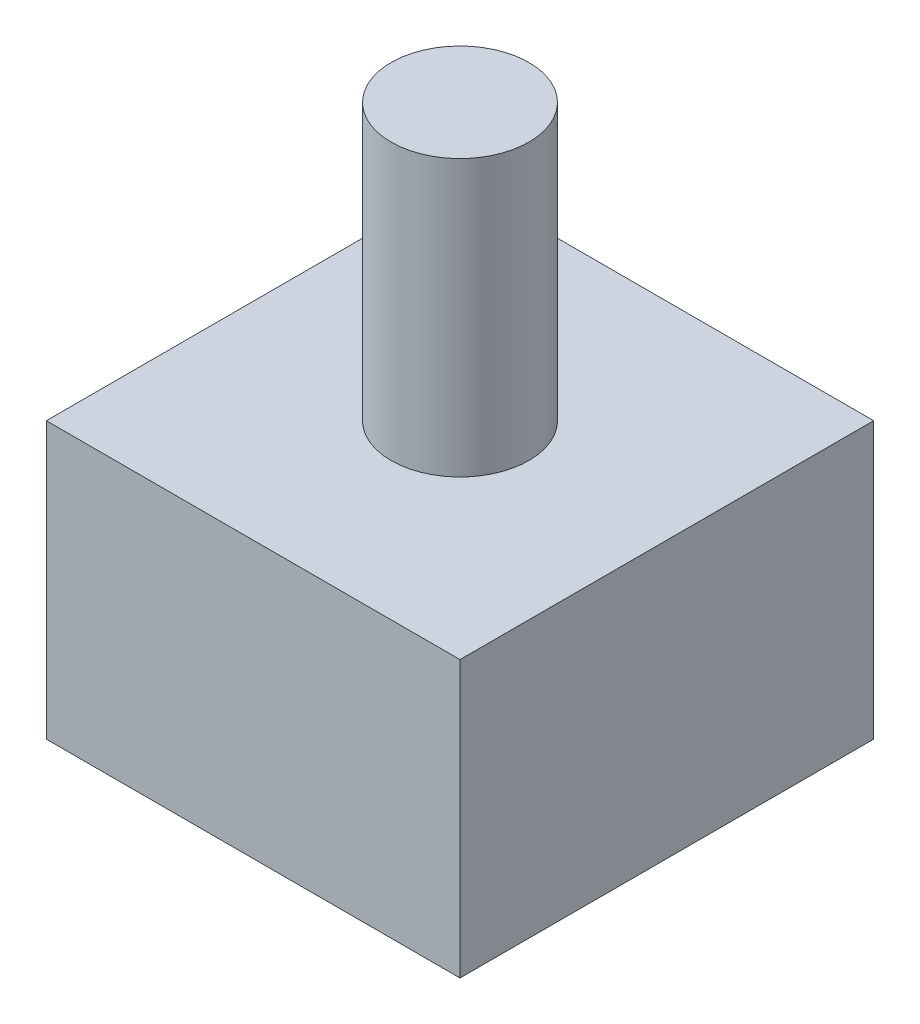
ISO-10303-21;
HEADER;
FILE_DESCRIPTION(('STEP AP214'),'2;1');
FILE_NAME('part.step','',(''),(''),'','','');
FILE_SCHEMA(('AUTOMOTIVE_DESIGN { 1 0 10303 214 1 1 1 1 }'));
ENDSEC;
DATA;
#1=APPLICATION_CONTEXT('core data for automotive mechanical design processes');
#2=APPLICATION_PROTOCOL_DEFINITION('international standard','automotive_design',2000,#1);
#3=PRODUCT_CONTEXT('',#1,'mechanical');
#4=PRODUCT('Part','Part','',(#3));
#5=PRODUCT_RELATED_PRODUCT_CATEGORY('part','',(#4));
#6=PRODUCT_DEFINITION_FORMATION('','',#4);
#7=PRODUCT_DEFINITION_CONTEXT('part definition',#1,'design');
#8=PRODUCT_DEFINITION('design','',#6,#7);
#9=PRODUCT_DEFINITION_SHAPE('','',#8);
#10=(LENGTH_UNIT() NAMED_UNIT(*) SI_UNIT(.MILLI.,.METRE.));
#11=(NAMED_UNIT(*) PLANE_ANGLE_UNIT() SI_UNIT($,.RADIAN.));
#12=(NAMED_UNIT(*) SI_UNIT($,.STERADIAN.) SOLID_ANGLE_UNIT());
#13=UNCERTAINTY_MEASURE_WITH_UNIT(LENGTH_MEASURE(1.E-05),#10,'distance_accuracy_value','');
#14=(GEOMETRIC_REPRESENTATION_CONTEXT(3) GLOBAL_UNCERTAINTY_ASSIGNED_CONTEXT((#13)) GLOBAL_UNIT_ASSIGNED_CONTEXT((#10,
#11,#12)) REPRESENTATION_CONTEXT('',''));
#15=CARTESIAN_POINT('',(0.,0.,0.));
#16=DIRECTION('',(0.,0.,1.));
#17=DIRECTION('',(1.,0.,0.));
#18=AXIS2_PLACEMENT_3D('',#15,#16,#17);
#19=CARTESIAN_POINT('',(0.,20.,0.));
#20=DIRECTION('',(0.,-1.,0.));
#21=DIRECTION('',(0.,0.,-1.));
#22=AXIS2_PLACEMENT_3D('',#19,#20,#21);
#23=CYLINDRICAL_SURFACE('',#22,2.5);
#24=CARTESIAN_POINT('',(0.,10.,0.));
#25=DIRECTION('',(0.,1.,0.));
#26=DIRECTION('',(0.,0.,1.));
#27=AXIS2_PLACEMENT_3D('',#24,#25,#26);
#28=CIRCLE('',#27,2.5);
#29=CARTESIAN_POINT('',(0.,10.,2.5));
#30=VERTEX_POINT('',#29);
#31=EDGE_CURVE('E135',#30,#30,#28,.T.);
#32=ORIENTED_EDGE('',*,*,#31,.T.);
#33=EDGE_LOOP('',(#32));
#34=FACE_BOUND('',#33,.T.);
#35=CARTESIAN_POINT('',(0.,20.,0.));
#36=DIRECTION('',(0.,1.,0.));
#37=DIRECTION('',(0.,0.,1.));
#38=AXIS2_PLACEMENT_3D('',#35,#36,#37);
#39=CIRCLE('',#38,2.5);
#40=CARTESIAN_POINT('',(0.,20.,2.5));
#41=VERTEX_POINT('',#40);
#42=EDGE_CURVE('E11',#41,#41,#39,.T.);
#43=ORIENTED_EDGE('',*,*,#42,.F.);
#44=EDGE_LOOP('',(#43));
#45=FACE_BOUND('',#44,.T.);
#46=ADVANCED_FACE('F50',(#34,#45),#23,.T.);
#47=CARTESIAN_POINT('',(0.,20.,0.));
#48=DIRECTION('',(0.,1.,0.));
#49=DIRECTION('',(0.,0.,1.));
#50=AXIS2_PLACEMENT_3D('',#47,#48,#49);
#51=PLANE('',#50);
#52=ORIENTED_EDGE('',*,*,#42,.T.);
#53=EDGE_LOOP('',(#52));
#54=FACE_BOUND('',#53,.T.);
#55=ADVANCED_FACE('F154',(#54),#51,.T.);
#56=CARTESIAN_POINT('',(0.,10.,7.5));
#57=DIRECTION('',(0.,0.,-1.));
#58=DIRECTION('',(-1.,0.,0.));
#59=AXIS2_PLACEMENT_3D('',#56,#57,#58);
#60=PLANE('',#59);
#61=DIRECTION('',(1.,0.,0.));
#62=VECTOR('',#61,1.);
#63=CARTESIAN_POINT('',(0.,0.,7.5));
#64=LINE('',#63,#62);
#65=CARTESIAN_POINT('',(-7.5,0.,7.5));
#66=VERTEX_POINT('',#65);
#67=CARTESIAN_POINT('',(7.5,0.,7.5));
#68=VERTEX_POINT('',#67);
#69=EDGE_CURVE('E123',#66,#68,#64,.T.);
#70=ORIENTED_EDGE('',*,*,#69,.T.);
#71=DIRECTION('',(0.,-1.,0.));
#72=VECTOR('',#71,1.);
#73=CARTESIAN_POINT('',(7.5,10.,7.5));
#74=LINE('',#73,#72);
#75=CARTESIAN_POINT('',(7.5,10.,7.5));
#76=VERTEX_POINT('',#75);
#77=EDGE_CURVE('E59',#76,#68,#74,.T.);
#78=ORIENTED_EDGE('',*,*,#77,.F.);
#79=DIRECTION('',(1.,0.,0.));
#80=VECTOR('',#79,1.);
#81=CARTESIAN_POINT('',(0.,10.,7.5));
#82=LINE('',#81,#80);
#83=CARTESIAN_POINT('',(-7.5,10.,7.5));
#84=VERTEX_POINT('',#83);
#85=EDGE_CURVE('E101',#84,#76,#82,.T.);
#86=ORIENTED_EDGE('',*,*,#85,.F.);
#87=DIRECTION('',(0.,-1.,0.));
#88=VECTOR('',#87,1.);
#89=CARTESIAN_POINT('',(-7.5,10.,7.5));
#90=LINE('',#89,#88);
#91=EDGE_CURVE('E67',#84,#66,#90,.T.);
#92=ORIENTED_EDGE('',*,*,#91,.T.);
#93=EDGE_LOOP('',(#70,#78,#86,#92));
#94=FACE_BOUND('',#93,.T.);
#95=ADVANCED_FACE('F140',(#94),#60,.F.);
#96=CARTESIAN_POINT('',(7.5,10.,0.));
#97=DIRECTION('',(-1.,0.,0.));
#98=DIRECTION('',(0.,0.,1.));
#99=AXIS2_PLACEMENT_3D('',#96,#97,#98);
#100=PLANE('',#99);
#101=DIRECTION('',(0.,0.,-1.));
#102=VECTOR('',#101,1.);
#103=CARTESIAN_POINT('',(7.5,0.,0.));
#104=LINE('',#103,#102);
#105=CARTESIAN_POINT('',(7.5,0.,-7.5));
#106=VERTEX_POINT('',#105);
#107=EDGE_CURVE('E108',#68,#106,#104,.T.);
#108=ORIENTED_EDGE('',*,*,#107,.T.);
#109=DIRECTION('',(0.,-1.,0.));
#110=VECTOR('',#109,1.);
#111=CARTESIAN_POINT('',(7.5,10.,-7.5));
#112=LINE('',#111,#110);
#113=CARTESIAN_POINT('',(7.5,10.,-7.5));
#114=VERTEX_POINT('',#113);
#115=EDGE_CURVE('E106',#114,#106,#112,.T.);
#116=ORIENTED_EDGE('',*,*,#115,.F.);
#117=DIRECTION('',(0.,0.,-1.));
#118=VECTOR('',#117,1.);
#119=CARTESIAN_POINT('',(7.5,10.,0.));
#120=LINE('',#119,#118);
#121=EDGE_CURVE('E93',#76,#114,#120,.T.);
#122=ORIENTED_EDGE('',*,*,#121,.F.);
#123=ORIENTED_EDGE('',*,*,#77,.T.);
#124=EDGE_LOOP('',(#108,#116,#122,#123));
#125=FACE_BOUND('',#124,.T.);
#126=ADVANCED_FACE('F107',(#125),#100,.F.);
#127=CARTESIAN_POINT('',(0.,10.,-7.5));
#128=DIRECTION('',(0.,0.,-1.));
#129=DIRECTION('',(-1.,0.,0.));
#130=AXIS2_PLACEMENT_3D('',#127,#128,#129);
#131=PLANE('',#130);
#132=DIRECTION('',(1.,0.,0.));
#133=VECTOR('',#132,1.);
#134=CARTESIAN_POINT('',(0.,0.,-7.5));
#135=LINE('',#134,#133);
#136=CARTESIAN_POINT('',(-7.5,0.,-7.5));
#137=VERTEX_POINT('',#136);
#138=EDGE_CURVE('E128',#137,#106,#135,.T.);
#139=ORIENTED_EDGE('',*,*,#138,.F.);
#140=DIRECTION('',(0.,-1.,0.));
#141=VECTOR('',#140,1.);
#142=CARTESIAN_POINT('',(-7.5,10.,-7.5));
#143=LINE('',#142,#141);
#144=CARTESIAN_POINT('',(-7.5,10.,-7.5));
#145=VERTEX_POINT('',#144);
#146=EDGE_CURVE('E81',#145,#137,#143,.T.);
#147=ORIENTED_EDGE('',*,*,#146,.F.);
#148=DIRECTION('',(1.,0.,0.));
#149=VECTOR('',#148,1.);
#150=CARTESIAN_POINT('',(0.,10.,-7.5));
#151=LINE('',#150,#149);
#152=EDGE_CURVE('E100',#145,#114,#151,.T.);
#153=ORIENTED_EDGE('',*,*,#152,.T.);
#154=ORIENTED_EDGE('',*,*,#115,.T.);
#155=EDGE_LOOP('',(#139,#147,#153,#154));
#156=FACE_BOUND('',#155,.T.);
#157=ADVANCED_FACE('F113',(#156),#131,.T.);
#158=CARTESIAN_POINT('',(-7.5,10.,0.));
#159=DIRECTION('',(-1.,0.,0.));
#160=DIRECTION('',(0.,0.,1.));
#161=AXIS2_PLACEMENT_3D('',#158,#159,#160);
#162=PLANE('',#161);
#163=DIRECTION('',(0.,0.,-1.));
#164=VECTOR('',#163,1.);
#165=CARTESIAN_POINT('',(-7.5,0.,0.));
#166=LINE('',#165,#164);
#167=EDGE_CURVE('E131',#66,#137,#166,.T.);
#168=ORIENTED_EDGE('',*,*,#167,.F.);
#169=ORIENTED_EDGE('',*,*,#91,.F.);
#170=DIRECTION('',(0.,0.,-1.));
#171=VECTOR('',#170,1.);
#172=CARTESIAN_POINT('',(-7.5,10.,0.));
#173=LINE('',#172,#171);
#174=EDGE_CURVE('E115',#84,#145,#173,.T.);
#175=ORIENTED_EDGE('',*,*,#174,.T.);
#176=ORIENTED_EDGE('',*,*,#146,.T.);
#177=EDGE_LOOP('',(#168,#169,#175,#176));
#178=FACE_BOUND('',#177,.T.);
#179=ADVANCED_FACE('F143',(#178),#162,.T.);
#180=CARTESIAN_POINT('',(0.,10.,0.));
#181=DIRECTION('',(0.,1.,0.));
#182=DIRECTION('',(0.,0.,1.));
#183=AXIS2_PLACEMENT_3D('',#180,#181,#182);
#184=PLANE('',#183);
#185=ORIENTED_EDGE('',*,*,#31,.F.);
#186=EDGE_LOOP('',(#185));
#187=FACE_BOUND('',#186,.T.);
#188=ORIENTED_EDGE('',*,*,#85,.T.);
#189=ORIENTED_EDGE('',*,*,#121,.T.);
#190=ORIENTED_EDGE('',*,*,#152,.F.);
#191=ORIENTED_EDGE('',*,*,#174,.F.);
#192=EDGE_LOOP('',(#188,#189,#190,#191));
#193=FACE_BOUND('',#192,.T.);
#194=ADVANCED_FACE('F97',(#187,#193),#184,.T.);
#195=CARTESIAN_POINT('',(0.,0.,0.));
#196=DIRECTION('',(0.,1.,0.));
#197=DIRECTION('',(0.,0.,1.));
#198=AXIS2_PLACEMENT_3D('',#195,#196,#197);
#199=PLANE('',#198);
#200=ORIENTED_EDGE('',*,*,#69,.F.);
#201=ORIENTED_EDGE('',*,*,#167,.T.);
#202=ORIENTED_EDGE('',*,*,#138,.T.);
#203=ORIENTED_EDGE('',*,*,#107,.F.);
#204=EDGE_LOOP('',(#200,#201,#202,#203));
#205=FACE_BOUND('',#204,.T.);
#206=ADVANCED_FACE('F142',(#205),#199,.F.);
#207=CLOSED_SHELL('',(#46,#55,#95,#126,#157,#179,#194,#206));
#208=MANIFOLD_SOLID_BREP('B2',#207);
#209=ADVANCED_BREP_SHAPE_REPRESENTATION('',(#18,#208),#14);
#210=SHAPE_DEFINITION_REPRESENTATION(#9,#209);
ENDSEC;
END-ISO-10303-21;
